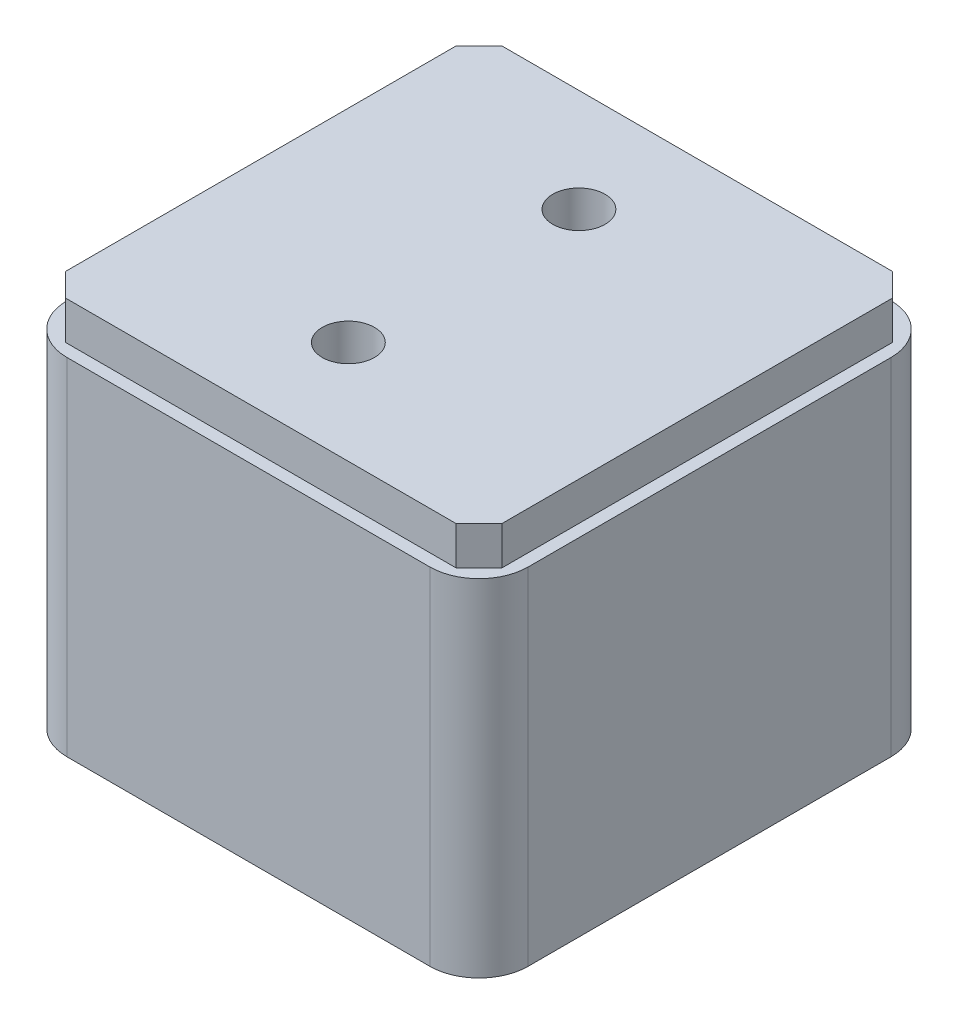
from build123d import *

# Parameters (mm, degrees)
EL_MENT_M_CANO_SOUD_1_DEPTH = 50
EMBOUT1_WIDTH               = 56.8
EMBOUT1_HEIGHT              = 56.8
EMBOUT1_THICKNESS           = 5
EMBOUT1_2_SIZE              = 3
TROU_TARAUD_M81_AT_2_COUNT  = 2
TROU_TARAUD_M81_AT_2_PITCH  = 30


with BuildPart() as part:
    # Sketch1 → El_ment m_cano-soud_1 (new body)
    with BuildSketch(Plane(origin=(0, 0, 0), x_dir=(-1, 0, 0), z_dir=(0, 1, 0))):
        with BuildLine():
            Line((-23.6, -30), (23.6, -30))
            ThreePointArc((23.6, -30), (28.1254834, -28.1254834), (30, -23.6))
            Line((30, -23.6), (30, 23.6))
            ThreePointArc((30, 23.6), (28.1254834, 28.1254834), (23.6, 30))
            Line((23.6, 30), (-23.6, 30))
            ThreePointArc((-23.6, 30), (-28.1254834, 28.1254834), (-30, 23.6))
            Line((-30, 23.6), (-30, -23.6))
            ThreePointArc((-30, -23.6), (-28.1254834, -28.1254834), (-23.6, -30))
        make_face()
        with BuildLine():
            Line((-23.6, -26.8), (23.6, -26.8))
            ThreePointArc((23.6, -26.8), (25.8627417, -25.8627417), (26.8, -23.6))
            Line((26.8, -23.6), (26.8, 23.6))
            ThreePointArc((26.8, 23.6), (25.8627417, 25.8627417), (23.6, 26.8))
            Line((23.6, 26.8), (-23.6, 26.8))
            ThreePointArc((-23.6, 26.8), (-25.8627417, 25.8627417), (-26.8, 23.6))
            Line((-26.8, 23.6), (-26.8, -23.6))
            ThreePointArc((-26.8, -23.6), (-25.8627417, -25.8627417), (-23.6, -26.8))
        make_face(mode=Mode.SUBTRACT)
    extrude(amount=EL_MENT_M_CANO_SOUD_1_DEPTH)

    # Embout1 3
    split(bisect_by=Plane.XZ.offset(-45), keep=Keep.TOP)


with BuildPart() as body_2:
    # Embout1: an end cap: a rectangular plate 5.0 thick over the member's open end
    with BuildSketch(Plane(origin=(0, 50, 0), x_dir=(-1, 0, 0), z_dir=(0, 1, 0))):
        Rectangle(EMBOUT1_WIDTH, EMBOUT1_HEIGHT)
    extrude(amount=-EMBOUT1_THICKNESS)

    # Embout1 2
    embout1_2_edges = [body_2.edges().sort_by_distance(p)[0] for p in [
        (28.4, 47.5, -28.4),
        (28.4, 47.5, 28.4),
        (-28.4, 47.5, -28.4),
        (-28.4, 47.5, 28.4),
    ]]
    chamfer(embout1_2_edges, length=EMBOUT1_2_SIZE)

    # Esquisse4 → Trou taraud_ M81 (revolve, cut)
    with BuildSketch(Plane(origin=(-2, 50, -15), x_dir=(0, 0, 1), z_dir=(1, 0, 0))):
        Polygon((0, 0), (0, 31.792926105), (3.4, 29.75), (3.4, 0), align=None)
    trou_taraud_m81 = revolve(axis=Axis((-2, 56.35, -15), (0, -1, 0)), mode=Mode.SUBTRACT)

    # Trou taraud_ M81 at 2: Trou taraud_ M81 ×2
    with Locations(*[(0, 0, i * TROU_TARAUD_M81_AT_2_PITCH) for i in range(1, TROU_TARAUD_M81_AT_2_COUNT)]):
        add(trou_taraud_m81, mode=Mode.SUBTRACT)


solid = Compound([part.part, body_2.part])
